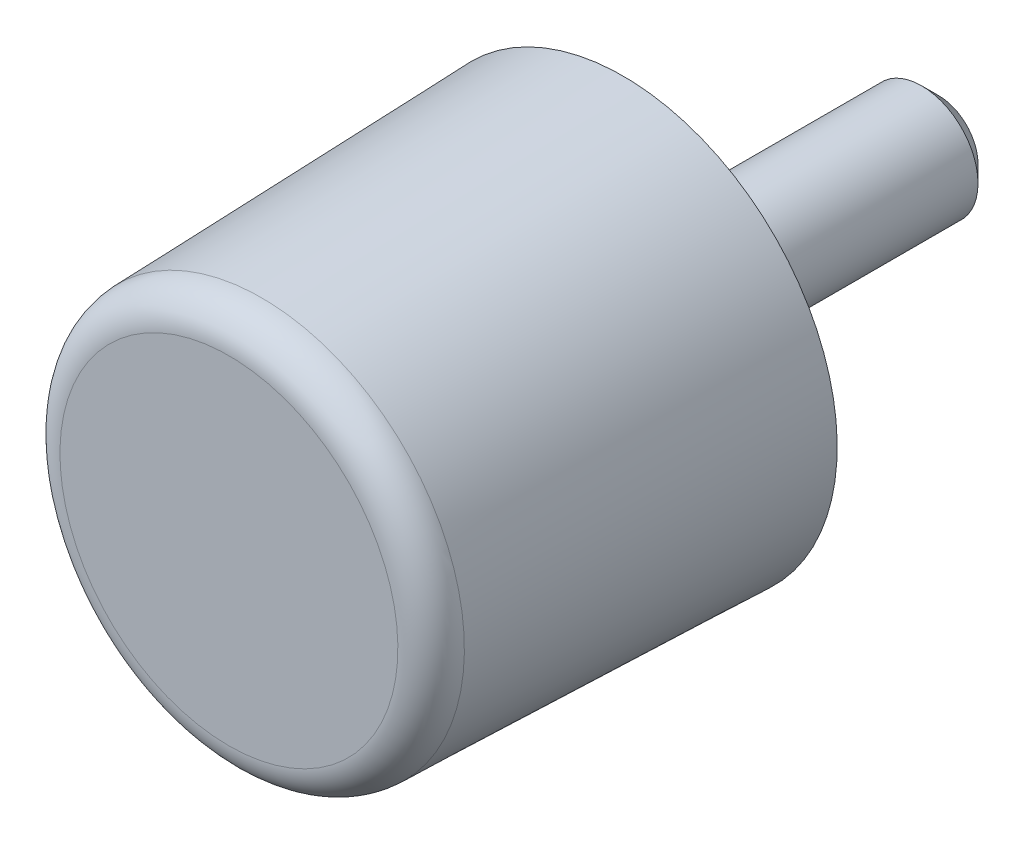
ISO-10303-21;
HEADER;
FILE_DESCRIPTION(('STEP AP214'),'2;1');
FILE_NAME('part.step','',(''),(''),'','','');
FILE_SCHEMA(('AUTOMOTIVE_DESIGN { 1 0 10303 214 1 1 1 1 }'));
ENDSEC;
DATA;
#1=APPLICATION_CONTEXT('core data for automotive mechanical design processes');
#2=APPLICATION_PROTOCOL_DEFINITION('international standard','automotive_design',2000,#1);
#3=PRODUCT_CONTEXT('',#1,'mechanical');
#4=PRODUCT('Part','Part','',(#3));
#5=PRODUCT_RELATED_PRODUCT_CATEGORY('part','',(#4));
#6=PRODUCT_DEFINITION_FORMATION('','',#4);
#7=PRODUCT_DEFINITION_CONTEXT('part definition',#1,'design');
#8=PRODUCT_DEFINITION('design','',#6,#7);
#9=PRODUCT_DEFINITION_SHAPE('','',#8);
#10=(LENGTH_UNIT() NAMED_UNIT(*) SI_UNIT(.MILLI.,.METRE.));
#11=(NAMED_UNIT(*) PLANE_ANGLE_UNIT() SI_UNIT($,.RADIAN.));
#12=(NAMED_UNIT(*) SI_UNIT($,.STERADIAN.) SOLID_ANGLE_UNIT());
#13=UNCERTAINTY_MEASURE_WITH_UNIT(LENGTH_MEASURE(1.E-05),#10,'distance_accuracy_value','');
#14=(GEOMETRIC_REPRESENTATION_CONTEXT(3) GLOBAL_UNCERTAINTY_ASSIGNED_CONTEXT((#13)) GLOBAL_UNIT_ASSIGNED_CONTEXT((#10,
#11,#12)) REPRESENTATION_CONTEXT('',''));
#15=CARTESIAN_POINT('',(0.,0.,0.));
#16=DIRECTION('',(0.,0.,1.));
#17=DIRECTION('',(1.,0.,0.));
#18=AXIS2_PLACEMENT_3D('',#15,#16,#17);
#19=CARTESIAN_POINT('',(0.,0.,35.));
#20=DIRECTION('',(0.,0.,1.));
#21=DIRECTION('',(0.,-1.,0.));
#22=AXIS2_PLACEMENT_3D('',#19,#20,#21);
#23=CYLINDRICAL_SURFACE('',#22,17.1);
#24=CARTESIAN_POINT('',(0.,0.,0.));
#25=DIRECTION('',(0.,0.,1.));
#26=DIRECTION('',(0.,-1.,0.));
#27=AXIS2_PLACEMENT_3D('',#24,#25,#26);
#28=CIRCLE('',#27,17.1);
#29=CARTESIAN_POINT('',(0.,-17.1,0.));
#30=VERTEX_POINT('',#29);
#31=EDGE_CURVE('E27',#30,#30,#28,.T.);
#32=ORIENTED_EDGE('',*,*,#31,.F.);
#33=EDGE_LOOP('',(#32));
#34=FACE_BOUND('',#33,.T.);
#35=CARTESIAN_POINT('',(0.,0.,0.0500000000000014));
#36=DIRECTION('',(0.,0.,1.));
#37=DIRECTION('',(0.,-1.,0.));
#38=AXIS2_PLACEMENT_3D('',#35,#36,#37);
#39=CIRCLE('',#38,17.1);
#40=CARTESIAN_POINT('',(0.,-17.1,0.0500000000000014));
#41=VERTEX_POINT('',#40);
#42=EDGE_CURVE('E44',#41,#41,#39,.T.);
#43=ORIENTED_EDGE('',*,*,#42,.T.);
#44=EDGE_LOOP('',(#43));
#45=FACE_BOUND('',#44,.T.);
#46=ADVANCED_FACE('F12',(#34,#45),#23,.F.);
#47=CARTESIAN_POINT('',(17.1,0.,0.));
#48=DIRECTION('',(0.,0.,1.));
#49=DIRECTION('',(0.,-1.,0.));
#50=AXIS2_PLACEMENT_3D('',#47,#48,#49);
#51=PLANE('',#50);
#52=CARTESIAN_POINT('',(0.,0.,0.));
#53=DIRECTION('',(0.,0.,1.));
#54=DIRECTION('',(0.,-1.,0.));
#55=AXIS2_PLACEMENT_3D('',#52,#53,#54);
#56=CIRCLE('',#55,19.);
#57=CARTESIAN_POINT('',(0.,-19.,0.));
#58=VERTEX_POINT('',#57);
#59=EDGE_CURVE('E32',#58,#58,#56,.T.);
#60=ORIENTED_EDGE('',*,*,#59,.F.);
#61=EDGE_LOOP('',(#60));
#62=FACE_BOUND('',#61,.T.);
#63=ORIENTED_EDGE('',*,*,#31,.T.);
#64=EDGE_LOOP('',(#63));
#65=FACE_BOUND('',#64,.T.);
#66=ADVANCED_FACE('F72',(#62,#65),#51,.F.);
#67=CARTESIAN_POINT('',(0.,0.,0.));
#68=DIRECTION('',(0.,0.,-1.));
#69=DIRECTION('',(0.,1.,0.));
#70=AXIS2_PLACEMENT_3D('',#67,#68,#69);
#71=CONICAL_SURFACE('',#70,19.,0.0311942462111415);
#72=CARTESIAN_POINT('',(0.,0.,32.0935675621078));
#73=DIRECTION('',(0.,0.,1.));
#74=DIRECTION('',(0.,-1.,0.));
#75=AXIS2_PLACEMENT_3D('',#72,#73,#74);
#76=CIRCLE('',#75,17.9985404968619);
#77=CARTESIAN_POINT('',(0.,-17.9985404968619,32.0935675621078));
#78=VERTEX_POINT('',#77);
#79=EDGE_CURVE('E35',#78,#78,#76,.T.);
#80=ORIENTED_EDGE('',*,*,#79,.F.);
#81=EDGE_LOOP('',(#80));
#82=FACE_BOUND('',#81,.T.);
#83=ORIENTED_EDGE('',*,*,#59,.T.);
#84=EDGE_LOOP('',(#83));
#85=FACE_BOUND('',#84,.T.);
#86=ADVANCED_FACE('F77',(#82,#85),#71,.T.);
#87=CARTESIAN_POINT('',(0.,0.,32.));
#88=DIRECTION('',(0.,0.,1.));
#89=DIRECTION('',(0.,-1.,0.));
#90=AXIS2_PLACEMENT_3D('',#87,#88,#89);
#91=TOROIDAL_SURFACE('',#90,15.,3.);
#92=ORIENTED_EDGE('',*,*,#79,.T.);
#93=EDGE_LOOP('',(#92));
#94=FACE_BOUND('',#93,.T.);
#95=CARTESIAN_POINT('',(0.,0.,35.));
#96=DIRECTION('',(0.,0.,1.));
#97=DIRECTION('',(0.,-1.,0.));
#98=AXIS2_PLACEMENT_3D('',#95,#96,#97);
#99=CIRCLE('',#98,15.);
#100=CARTESIAN_POINT('',(0.,-15.,35.));
#101=VERTEX_POINT('',#100);
#102=EDGE_CURVE('E38',#101,#101,#99,.T.);
#103=ORIENTED_EDGE('',*,*,#102,.F.);
#104=EDGE_LOOP('',(#103));
#105=FACE_BOUND('',#104,.T.);
#106=ADVANCED_FACE('F84',(#94,#105),#91,.T.);
#107=CARTESIAN_POINT('',(15.,0.,35.));
#108=DIRECTION('',(0.,0.,-1.));
#109=DIRECTION('',(0.,1.,0.));
#110=AXIS2_PLACEMENT_3D('',#107,#108,#109);
#111=PLANE('',#110);
#112=ORIENTED_EDGE('',*,*,#102,.T.);
#113=EDGE_LOOP('',(#112));
#114=FACE_BOUND('',#113,.T.);
#115=ADVANCED_FACE('F59',(#114),#111,.F.);
#116=CARTESIAN_POINT('',(0.,0.,0.));
#117=DIRECTION('',(0.,0.,1.));
#118=DIRECTION('',(0.,-1.,0.));
#119=AXIS2_PLACEMENT_3D('',#116,#117,#118);
#120=PLANE('',#119);
#121=CARTESIAN_POINT('',(0.,0.,0.));
#122=DIRECTION('',(0.,0.,1.));
#123=DIRECTION('',(0.,-1.,0.));
#124=AXIS2_PLACEMENT_3D('',#121,#122,#123);
#125=CIRCLE('',#124,17.05);
#126=CARTESIAN_POINT('',(0.,-17.05,0.));
#127=VERTEX_POINT('',#126);
#128=EDGE_CURVE('E41',#127,#127,#125,.T.);
#129=ORIENTED_EDGE('',*,*,#128,.F.);
#130=EDGE_LOOP('',(#129));
#131=FACE_BOUND('',#130,.T.);
#132=CARTESIAN_POINT('',(0.,0.,0.));
#133=DIRECTION('',(0.,0.,1.));
#134=DIRECTION('',(0.,-1.,0.));
#135=AXIS2_PLACEMENT_3D('',#132,#133,#134);
#136=CIRCLE('',#135,5.);
#137=CARTESIAN_POINT('',(0.,-5.,0.));
#138=VERTEX_POINT('',#137);
#139=EDGE_CURVE('E23',#138,#138,#136,.T.);
#140=ORIENTED_EDGE('',*,*,#139,.T.);
#141=EDGE_LOOP('',(#140));
#142=FACE_BOUND('',#141,.T.);
#143=ADVANCED_FACE('F53',(#131,#142),#120,.F.);
#144=CARTESIAN_POINT('',(0.,0.,0.));
#145=DIRECTION('',(0.,0.,1.));
#146=DIRECTION('',(0.,-1.,0.));
#147=AXIS2_PLACEMENT_3D('',#144,#145,#146);
#148=CONICAL_SURFACE('',#147,17.05,0.785398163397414);
#149=ORIENTED_EDGE('',*,*,#42,.F.);
#150=EDGE_LOOP('',(#149));
#151=FACE_BOUND('',#150,.T.);
#152=ORIENTED_EDGE('',*,*,#128,.T.);
#153=EDGE_LOOP('',(#152));
#154=FACE_BOUND('',#153,.T.);
#155=ADVANCED_FACE('F49',(#151,#154),#148,.T.);
#156=CARTESIAN_POINT('',(0.,0.,35.));
#157=DIRECTION('',(0.,0.,1.));
#158=DIRECTION('',(0.,-1.,0.));
#159=AXIS2_PLACEMENT_3D('',#156,#157,#158);
#160=CYLINDRICAL_SURFACE('',#159,5.);
#161=CARTESIAN_POINT('',(0.,0.,-26.5));
#162=DIRECTION('',(0.,0.,-1.));
#163=DIRECTION('',(0.,1.,0.));
#164=AXIS2_PLACEMENT_3D('',#161,#162,#163);
#165=CIRCLE('',#164,5.);
#166=CARTESIAN_POINT('',(0.,5.,-26.5));
#167=VERTEX_POINT('',#166);
#168=EDGE_CURVE('E8',#167,#167,#165,.F.);
#169=ORIENTED_EDGE('',*,*,#168,.T.);
#170=EDGE_LOOP('',(#169));
#171=FACE_BOUND('',#170,.T.);
#172=ORIENTED_EDGE('',*,*,#139,.F.);
#173=EDGE_LOOP('',(#172));
#174=FACE_BOUND('',#173,.T.);
#175=ADVANCED_FACE('F52',(#171,#174),#160,.T.);
#176=CARTESIAN_POINT('',(0.,0.,-28.));
#177=DIRECTION('',(0.,0.,-1.));
#178=DIRECTION('',(0.,1.,0.));
#179=AXIS2_PLACEMENT_3D('',#176,#177,#178);
#180=PLANE('',#179);
#181=CARTESIAN_POINT('',(0.,0.,-28.));
#182=DIRECTION('',(0.,0.,-1.));
#183=DIRECTION('',(0.,1.,0.));
#184=AXIS2_PLACEMENT_3D('',#181,#182,#183);
#185=CIRCLE('',#184,3.5);
#186=CARTESIAN_POINT('',(0.,3.5,-28.));
#187=VERTEX_POINT('',#186);
#188=EDGE_CURVE('E19',#187,#187,#185,.T.);
#189=ORIENTED_EDGE('',*,*,#188,.T.);
#190=EDGE_LOOP('',(#189));
#191=FACE_BOUND('',#190,.T.);
#192=ADVANCED_FACE('F64',(#191),#180,.T.);
#193=CARTESIAN_POINT('',(0.,0.,-28.));
#194=DIRECTION('',(0.,0.,1.));
#195=DIRECTION('',(0.,-1.,0.));
#196=AXIS2_PLACEMENT_3D('',#193,#194,#195);
#197=CONICAL_SURFACE('',#196,3.5,0.785398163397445);
#198=ORIENTED_EDGE('',*,*,#168,.F.);
#199=EDGE_LOOP('',(#198));
#200=FACE_BOUND('',#199,.T.);
#201=ORIENTED_EDGE('',*,*,#188,.F.);
#202=EDGE_LOOP('',(#201));
#203=FACE_BOUND('',#202,.T.);
#204=ADVANCED_FACE('F14',(#200,#203),#197,.T.);
#205=CLOSED_SHELL('',(#46,#66,#86,#106,#115,#143,#155,#175,#192,#204));
#206=MANIFOLD_SOLID_BREP('B1',#205);
#207=ADVANCED_BREP_SHAPE_REPRESENTATION('',(#18,#206),#14);
#208=SHAPE_DEFINITION_REPRESENTATION(#9,#207);
ENDSEC;
END-ISO-10303-21;
